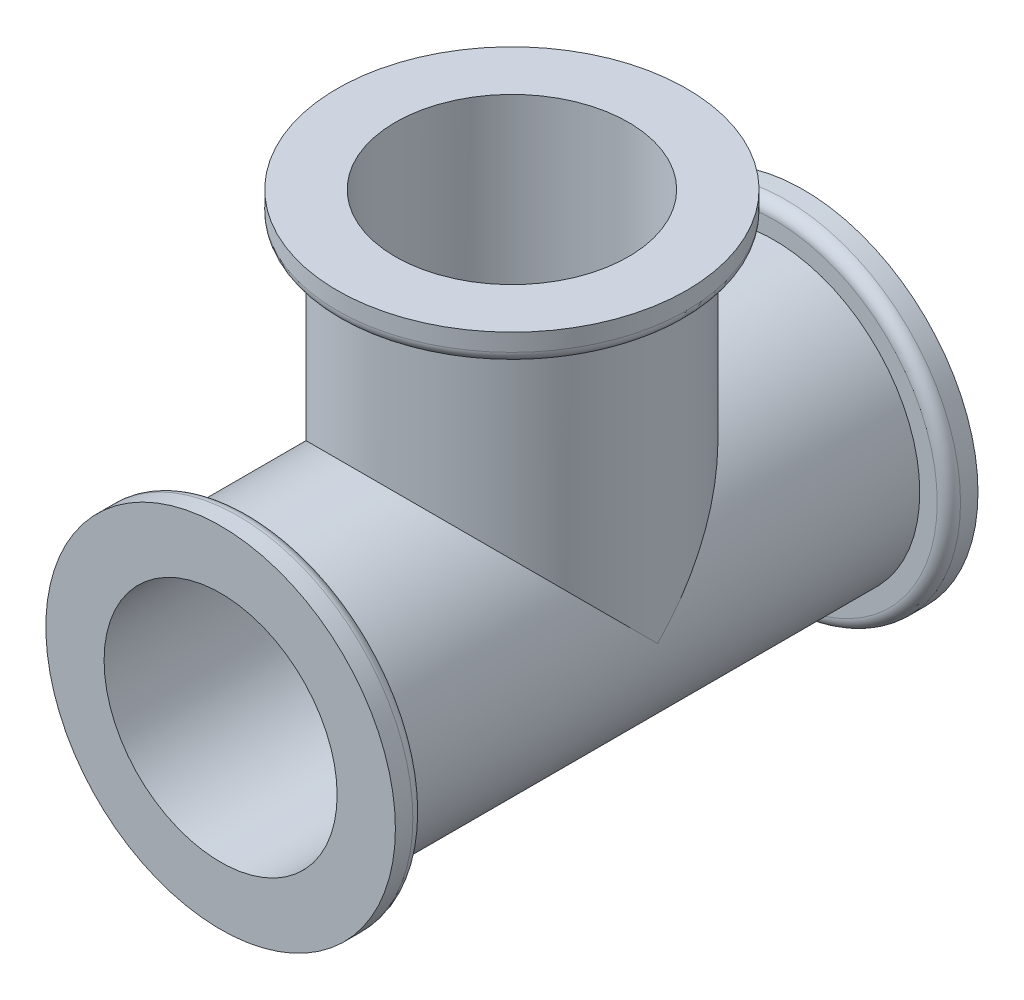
from build123d import *
from build123d.topology import SkipClean

# Parameters (mm, degrees)
CROQUIS1_R            = 15
CROQUIS1_R_2          = 10
EXTRUIR_L_MINA1_DEPTH = 2.5
EXTRUIR_L_MINA2_START = 45
CROQUIS2_R            = 12.5
CROQUIS2_R_2          = 10
EXTRUIR_L_MINA2_DEPTH = 45
REDONDEO3_R           = 1
CROQUIS5_R            = 12.5
CROQUIS5_R_2          = 10
EXTRUIR_L_MINA3_DEPTH = 25
CROQUIS6_R            = 15
CROQUIS6_R_2          = 10
EXTRUIR_L_MINA4_DEPTH = 2.5
REDONDEO4_R           = 1
CROQUIS7_R            = 10
CORTAR_EXTRUIR1_DEPTH = 60.002118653
CORTAR_EXTRUIR2_START = -28
CROQUIS8_R            = 10
CORTAR_EXTRUIR2_DEPTH = 28


with BuildPart() as part:
    # Croquis1 → Extruir-L_mina1 (new body)
    with BuildSketch(Plane.XY):
        Circle(CROQUIS1_R)
        Circle(CROQUIS1_R_2, mode=Mode.SUBTRACT)
    extruir_l_mina1 = extrude(amount=EXTRUIR_L_MINA1_DEPTH)

    # Croquis2 → Extruir-L_mina2 (add)
    with SkipClean():  # the faces are left unmerged after this step: merging them gives an invalid solid
        with BuildSketch(Plane(origin=(0, 0, 0), x_dir=(-1, 0, 0), z_dir=(0, 0, -1)).offset(EXTRUIR_L_MINA2_START)):
            Circle(CROQUIS2_R)
            Circle(CROQUIS2_R_2, mode=Mode.SUBTRACT)
        extrude(amount=-EXTRUIR_L_MINA2_DEPTH)

    # Simetr_a1: Extruir-L_mina1 across plane
    with SkipClean():  # the faces are left unmerged after this step: merging them gives an invalid solid
        add(extruir_l_mina1.mirror(Plane.XY.offset(-22.5)))

    # Redondeo3
    redondeo3_edges = [part.edges().sort_by_distance(p)[0] for p in [
        (-15, 0, -45),
        (-15, 0, 0),
    ]]
    fillet(redondeo3_edges, radius=REDONDEO3_R)

    # Croquis5 → Extruir-L_mina3 (add)
    with SkipClean():  # the faces are left unmerged after this step: merging them gives an invalid solid
        with BuildSketch(Plane(origin=(0, 0, 0), x_dir=(1, 0, 0), z_dir=(0, 1, 0))):
            with Locations((0, 22.5)):
                Circle(CROQUIS5_R)
            with Locations((0, 22.5)):
                Circle(CROQUIS5_R_2, mode=Mode.SUBTRACT)
        extrude(amount=EXTRUIR_L_MINA3_DEPTH)

    # Croquis6 → Extruir-L_mina4 (add)
    with SkipClean():  # the faces are left unmerged after this step: merging them gives an invalid solid
        with BuildSketch(Plane(origin=(0, 25, 0), x_dir=(1, 0, 0), z_dir=(0, 1, 0))):
            with Locations((0, 22.5)):
                Circle(CROQUIS6_R)
            with Locations((0, 22.5)):
                Circle(CROQUIS6_R_2, mode=Mode.SUBTRACT)
        extrude(amount=EXTRUIR_L_MINA4_DEPTH)

    # Redondeo4
    redondeo4_edges = [part.edges().sort_by_distance(p)[0] for p in [
        (-15, 25, -22.5),
    ]]
    fillet(redondeo4_edges, radius=REDONDEO4_R)

    # Croquis7 → Cortar-Extruir1 (cut, through all)
    with BuildSketch(Plane(origin=(0, 0, -47.5), x_dir=(-1, 0, 0), z_dir=(0, 0, -1))):
        with Locations(Location((0, 0, 0), (0, 0, 180))):
            Circle(CROQUIS7_R)
    extrude(amount=-CORTAR_EXTRUIR1_DEPTH, mode=Mode.SUBTRACT)

    # Croquis8 → Cortar-Extruir2 (cut)
    with SkipClean():  # the faces are left unmerged after this step: merging them gives an invalid solid
        with BuildSketch(Plane(origin=(0, 27.5, 0), x_dir=(1, 0, 0), z_dir=(0, 1, 0)).offset(CORTAR_EXTRUIR2_START)):
            with Locations(Location((0, 22.5, 0), (0, 0, 180))):
                Circle(CROQUIS8_R)
        extrude(amount=CORTAR_EXTRUIR2_DEPTH, mode=Mode.SUBTRACT)


solid = part.part
